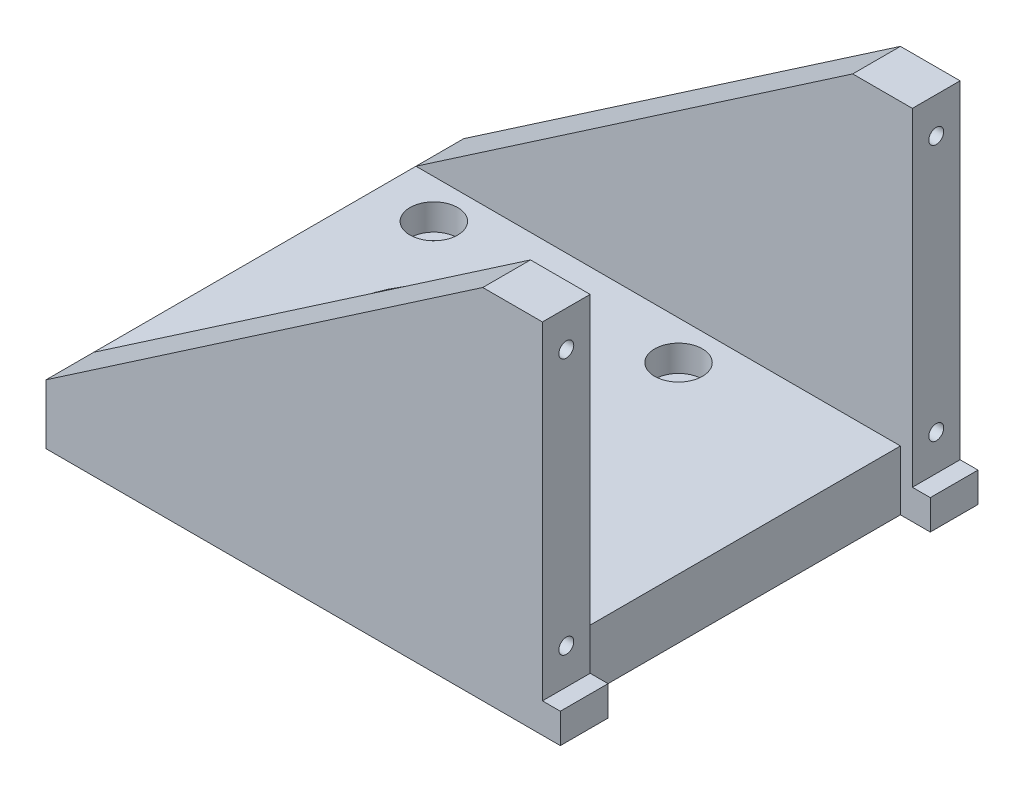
from build123d import *

# Parameters (mm, degrees)
BOSS_EXTRU_1_DEPTH                                 = 35
ENL_V_MAT_EXTRU_1_DEPTH                            = 90.350097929
ENL_V_MAT_EXTRU_1_DEPTH_BACK                       = 90.350097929
ESQUISSE3_W                                        = 54
ESQUISSE3_H                                        = 50
ENL_V_MAT_EXTRU_2_DEPTH                            = 109.384685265
ENL_V_MAT_EXTRU_2_DEPTH_BACK                       = 2
ESQUISSE4_W                                        = 54
ESQUISSE4_H                                        = 10
CHAMBRAGE_POUR_VIS_T_TE_HEXAGONALE_M41_D           = 4.5
CHAMBRAGE_POUR_VIS_T_TE_HEXAGONALE_M41_CBORE_D     = 8
CHAMBRAGE_POUR_VIS_T_TE_HEXAGONALE_M41_CBORE_DEPTH = 4.4
R_P_TITION_CIRCULAIRE1_COUNT                       = 4
TROU_TARAUD_M31_D                                  = 2.5
TROU_TARAUD_M31_DEPTH                              = 11
TROU_TARAUD_M31_TIP                                = 0.751075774


with BuildPart() as part:
    # Esquisse1 → Boss.-Extru.1 (new, symmetric)
    with BuildSketch(Plane.XY):
        Polygon((-30, 10), (-30, 0), (56.2, 0), (56.2, 5), (53.2, 5), (53.2, 60), (43.2, 60), align=None)
    extrude(amount=BOSS_EXTRU_1_DEPTH, both=True)

    # Esquisse2 → Enl_vement de mati_re-R_volution1 (revolve, cut)
    with BuildSketch(Plane.XY, mode=Mode.PRIVATE) as enl_vement_de_mati_re_r_volution1_sk:
        Polygon((0, 0), (0, 80), (16, 80), (16, 2.5), (24.05, 2.5), (24.05, 0), align=None)
    revolve(enl_vement_de_mati_re_r_volution1_sk.sketch.rotate(Axis((0, 90.018508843, 0), (0, -1, 0)), 180), axis=Axis((0, 90.018508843, 0), (0, -1, 0)), mode=Mode.SUBTRACT)

    # Esquisse3 → Enl_v. mat.-Extru.1 (cut, two sides: drawn at the far end of the back side and taken through both)
    with BuildSketch(Plane(origin=(0, 0, 0), x_dir=(0, 0, -1), z_dir=(1, 0, 0)).offset(-ENL_V_MAT_EXTRU_1_DEPTH_BACK)):
        with Locations((0, 35)):
            Rectangle(ESQUISSE3_W, ESQUISSE3_H)
    extrude(amount=ENL_V_MAT_EXTRU_1_DEPTH + ENL_V_MAT_EXTRU_1_DEPTH_BACK, mode=Mode.SUBTRACT)

    # Esquisse4 → Enl_v. mat.-Extru.2 (cut, two sides: drawn at the far end of the back side and taken through both)
    with BuildSketch(Plane(origin=(53.2, 0, 0), x_dir=(0, 0, -1), z_dir=(1, 0, 0)).offset(-ENL_V_MAT_EXTRU_2_DEPTH_BACK)):
        with Locations((0, 5)):
            Rectangle(ESQUISSE4_W, ESQUISSE4_H)
    extrude(amount=ENL_V_MAT_EXTRU_2_DEPTH + ENL_V_MAT_EXTRU_2_DEPTH_BACK, mode=Mode.SUBTRACT)

    # Chambrage pour vis _ t_te hexagonale M41 (through all)
    with Locations(Plane(origin=(0, 10, 0), x_dir=(1, 0, 0), z_dir=(0, 1, 0))):
        with Locations((20.506096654, 20.506096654)):
            chambrage_pour_vis_t_te_hexagonale_m41 = CounterBoreHole(CHAMBRAGE_POUR_VIS_T_TE_HEXAGONALE_M41_D / 2, CHAMBRAGE_POUR_VIS_T_TE_HEXAGONALE_M41_CBORE_D / 2, CHAMBRAGE_POUR_VIS_T_TE_HEXAGONALE_M41_CBORE_DEPTH)

    # R_p_tition circulaire1: Chambrage pour vis _ t_te hexagonale M41 ×4 about axis
    r_p_tition_circulaire1_axis = Axis((0, 0, 0), (0, 1, 0))
    for i in range(1, R_P_TITION_CIRCULAIRE1_COUNT):
        add(chambrage_pour_vis_t_te_hexagonale_m41.rotate(r_p_tition_circulaire1_axis, i * 360 / R_P_TITION_CIRCULAIRE1_COUNT), mode=Mode.SUBTRACT)

    # Trou taraud_ M31
    with Locations(Plane(origin=(53.2, 0, 0), x_dir=(0, 0, -1), z_dir=(1, 0, 0))):
        with Locations((-31, 11), (-31, 54), (31, 54), (31, 11)):
            Hole(TROU_TARAUD_M31_D / 2, depth=TROU_TARAUD_M31_DEPTH)
            with Locations((0, 0, -(TROU_TARAUD_M31_DEPTH + TROU_TARAUD_M31_TIP / 2))):  # 118° drill point
                Cone(0, TROU_TARAUD_M31_D / 2, TROU_TARAUD_M31_TIP, mode=Mode.SUBTRACT)


solid = part.part
